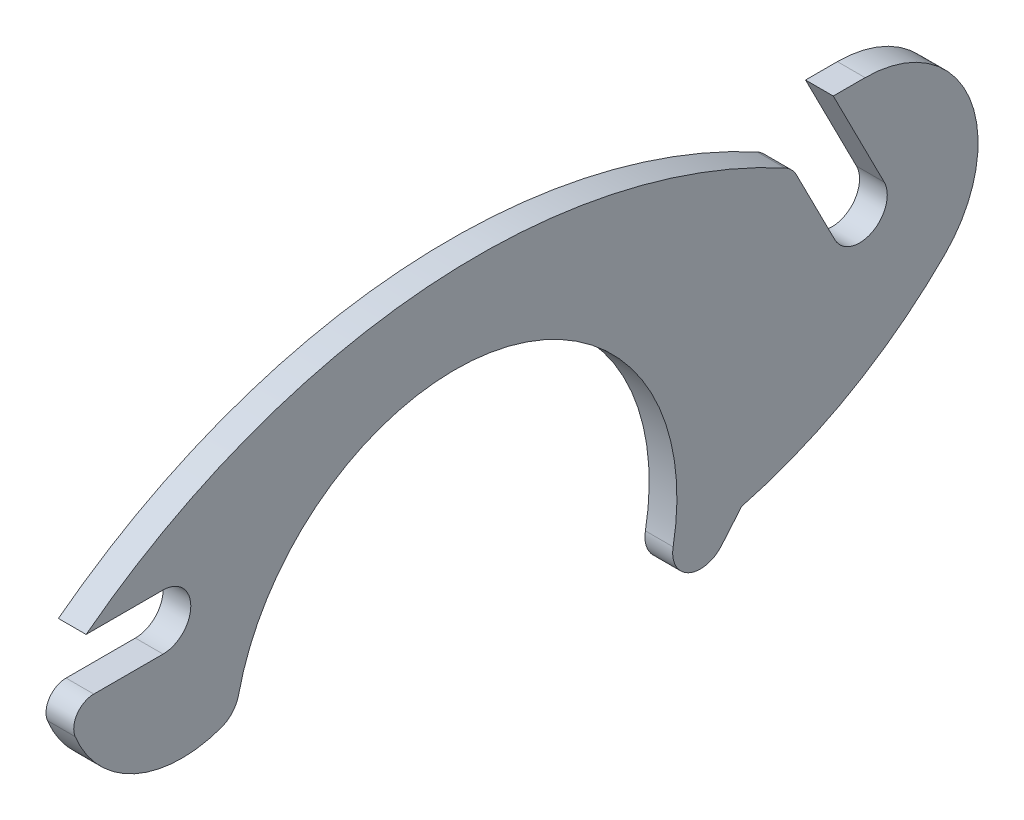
ISO-10303-21;
HEADER;
FILE_DESCRIPTION(('STEP AP214'),'2;1');
FILE_NAME('part.step','',(''),(''),'','','');
FILE_SCHEMA(('AUTOMOTIVE_DESIGN { 1 0 10303 214 1 1 1 1 }'));
ENDSEC;
DATA;
#1=APPLICATION_CONTEXT('core data for automotive mechanical design processes');
#2=APPLICATION_PROTOCOL_DEFINITION('international standard','automotive_design',2000,#1);
#3=PRODUCT_CONTEXT('',#1,'mechanical');
#4=PRODUCT('Part','Part','',(#3));
#5=PRODUCT_RELATED_PRODUCT_CATEGORY('part','',(#4));
#6=PRODUCT_DEFINITION_FORMATION('','',#4);
#7=PRODUCT_DEFINITION_CONTEXT('part definition',#1,'design');
#8=PRODUCT_DEFINITION('design','',#6,#7);
#9=PRODUCT_DEFINITION_SHAPE('','',#8);
#10=(LENGTH_UNIT() NAMED_UNIT(*) SI_UNIT(.MILLI.,.METRE.));
#11=(NAMED_UNIT(*) PLANE_ANGLE_UNIT() SI_UNIT($,.RADIAN.));
#12=(NAMED_UNIT(*) SI_UNIT($,.STERADIAN.) SOLID_ANGLE_UNIT());
#13=UNCERTAINTY_MEASURE_WITH_UNIT(LENGTH_MEASURE(1.E-05),#10,'distance_accuracy_value','');
#14=(GEOMETRIC_REPRESENTATION_CONTEXT(3) GLOBAL_UNCERTAINTY_ASSIGNED_CONTEXT((#13)) GLOBAL_UNIT_ASSIGNED_CONTEXT((#10,
#11,#12)) REPRESENTATION_CONTEXT('',''));
#15=CARTESIAN_POINT('',(0.,0.,0.));
#16=DIRECTION('',(0.,0.,1.));
#17=DIRECTION('',(1.,0.,0.));
#18=AXIS2_PLACEMENT_3D('',#15,#16,#17);
#19=CARTESIAN_POINT('',(2.,3.87717609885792,-3.05632741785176));
#20=DIRECTION('',(-1.,0.,0.));
#21=DIRECTION('',(0.,0.,1.));
#22=AXIS2_PLACEMENT_3D('',#19,#20,#21);
#23=CYLINDRICAL_SURFACE('',#22,1.99369295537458);
#24=CARTESIAN_POINT('',(0.,3.87717609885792,-3.05632741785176));
#25=DIRECTION('',(1.,0.,0.));
#26=DIRECTION('',(0.,0.,-1.));
#27=AXIS2_PLACEMENT_3D('',#24,#25,#26);
#28=CIRCLE('',#27,1.99369295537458);
#29=CARTESIAN_POINT('',(0.,2.00102391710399,-3.7307639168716));
#30=VERTEX_POINT('',#29);
#31=CARTESIAN_POINT('',(0.,3.44092293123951,-5.00170521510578));
#32=VERTEX_POINT('',#31);
#33=EDGE_CURVE('E183',#30,#32,#28,.T.);
#34=ORIENTED_EDGE('',*,*,#33,.T.);
#35=DIRECTION('',(-1.,0.,0.));
#36=VECTOR('',#35,1.);
#37=CARTESIAN_POINT('',(2.,3.44092293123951,-5.00170521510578));
#38=LINE('',#37,#36);
#39=CARTESIAN_POINT('',(2.,3.44092293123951,-5.00170521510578));
#40=VERTEX_POINT('',#39);
#41=EDGE_CURVE('E11',#40,#32,#38,.T.);
#42=ORIENTED_EDGE('',*,*,#41,.F.);
#43=CARTESIAN_POINT('',(2.,3.87717609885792,-3.05632741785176));
#44=DIRECTION('',(1.,0.,0.));
#45=DIRECTION('',(0.,0.,-1.));
#46=AXIS2_PLACEMENT_3D('',#43,#44,#45);
#47=CIRCLE('',#46,1.99369295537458);
#48=CARTESIAN_POINT('',(2.,2.00102391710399,-3.7307639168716));
#49=VERTEX_POINT('',#48);
#50=EDGE_CURVE('E215',#49,#40,#47,.T.);
#51=ORIENTED_EDGE('',*,*,#50,.F.);
#52=DIRECTION('',(-1.,0.,0.));
#53=VECTOR('',#52,1.);
#54=CARTESIAN_POINT('',(2.,2.00102391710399,-3.7307639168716));
#55=LINE('',#54,#53);
#56=EDGE_CURVE('E179',#49,#30,#55,.T.);
#57=ORIENTED_EDGE('',*,*,#56,.T.);
#58=EDGE_LOOP('',(#34,#42,#51,#57));
#59=FACE_BOUND('',#58,.T.);
#60=ADVANCED_FACE('F33',(#59),#23,.T.);
#61=CARTESIAN_POINT('',(2.,-0.0601430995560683,-20.613961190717));
#62=DIRECTION('',(-1.,0.,0.));
#63=DIRECTION('',(0.,0.,1.));
#64=AXIS2_PLACEMENT_3D('',#61,#62,#63);
#65=CYLINDRICAL_SURFACE('',#64,16.);
#66=CARTESIAN_POINT('',(0.,-0.0601430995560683,-20.613961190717));
#67=DIRECTION('',(-1.,0.,0.));
#68=DIRECTION('',(0.,0.,1.));
#69=AXIS2_PLACEMENT_3D('',#66,#67,#68);
#70=CIRCLE('',#69,16.);
#71=CARTESIAN_POINT('',(0.,-3.00000000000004,-36.3415560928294));
#72=VERTEX_POINT('',#71);
#73=EDGE_CURVE('E186',#32,#72,#70,.T.);
#74=ORIENTED_EDGE('',*,*,#73,.T.);
#75=DIRECTION('',(-1.,0.,0.));
#76=VECTOR('',#75,1.);
#77=CARTESIAN_POINT('',(2.,-3.00000000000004,-36.3415560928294));
#78=LINE('',#77,#76);
#79=CARTESIAN_POINT('',(2.,-3.00000000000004,-36.3415560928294));
#80=VERTEX_POINT('',#79);
#81=EDGE_CURVE('E41',#80,#72,#78,.T.);
#82=ORIENTED_EDGE('',*,*,#81,.F.);
#83=CARTESIAN_POINT('',(2.,-0.0601430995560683,-20.613961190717));
#84=DIRECTION('',(-1.,0.,0.));
#85=DIRECTION('',(0.,0.,1.));
#86=AXIS2_PLACEMENT_3D('',#83,#84,#85);
#87=CIRCLE('',#86,16.);
#88=EDGE_CURVE('E119',#40,#80,#87,.T.);
#89=ORIENTED_EDGE('',*,*,#88,.F.);
#90=ORIENTED_EDGE('',*,*,#41,.T.);
#91=EDGE_LOOP('',(#74,#82,#89,#90));
#92=FACE_BOUND('',#91,.T.);
#93=ADVANCED_FACE('F318',(#92),#65,.F.);
#94=CARTESIAN_POINT('',(2.,-3.36748211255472,-38.3075054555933));
#95=DIRECTION('',(-1.,0.,0.));
#96=DIRECTION('',(0.,0.,1.));
#97=AXIS2_PLACEMENT_3D('',#94,#95,#96);
#98=CYLINDRICAL_SURFACE('',#97,1.99999999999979);
#99=CARTESIAN_POINT('',(0.,-3.36748211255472,-38.3075054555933));
#100=DIRECTION('',(1.,0.,0.));
#101=DIRECTION('',(0.,0.,-1.));
#102=AXIS2_PLACEMENT_3D('',#99,#100,#101);
#103=CIRCLE('',#102,1.99999999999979);
#104=CARTESIAN_POINT('',(0.,-4.65605414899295,-39.8370747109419));
#105=VERTEX_POINT('',#104);
#106=EDGE_CURVE('E188',#72,#105,#103,.T.);
#107=ORIENTED_EDGE('',*,*,#106,.T.);
#108=DIRECTION('',(-1.,0.,0.));
#109=VECTOR('',#108,1.);
#110=CARTESIAN_POINT('',(2.,-4.65605414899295,-39.8370747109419));
#111=LINE('',#110,#109);
#112=CARTESIAN_POINT('',(2.,-4.65605414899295,-39.8370747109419));
#113=VERTEX_POINT('',#112);
#114=EDGE_CURVE('E249',#113,#105,#111,.T.);
#115=ORIENTED_EDGE('',*,*,#114,.F.);
#116=CARTESIAN_POINT('',(2.,-3.36748211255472,-38.3075054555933));
#117=DIRECTION('',(1.,0.,0.));
#118=DIRECTION('',(0.,0.,-1.));
#119=AXIS2_PLACEMENT_3D('',#116,#117,#118);
#120=CIRCLE('',#119,1.99999999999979);
#121=EDGE_CURVE('E257',#80,#113,#120,.T.);
#122=ORIENTED_EDGE('',*,*,#121,.F.);
#123=ORIENTED_EDGE('',*,*,#81,.T.);
#124=EDGE_LOOP('',(#107,#115,#122,#123));
#125=FACE_BOUND('',#124,.T.);
#126=ADVANCED_FACE('F255',(#125),#98,.T.);
#127=CARTESIAN_POINT('',(2.,-4.65605414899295,-39.8370747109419));
#128=DIRECTION('',(0.,0.644286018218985,0.764784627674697));
#129=DIRECTION('',(0.,-0.764784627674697,0.644286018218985));
#130=AXIS2_PLACEMENT_3D('',#127,#128,#129);
#131=PLANE('',#130);
#132=DIRECTION('',(0.,0.764784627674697,-0.644286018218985));
#133=VECTOR('',#132,1.);
#134=CARTESIAN_POINT('',(0.,-4.65605414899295,-39.8370747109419));
#135=LINE('',#134,#133);
#136=CARTESIAN_POINT('',(0.,-2.94594373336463,-41.2777420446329));
#137=VERTEX_POINT('',#136);
#138=EDGE_CURVE('E190',#105,#137,#135,.T.);
#139=ORIENTED_EDGE('',*,*,#138,.T.);
#140=DIRECTION('',(-1.,0.,0.));
#141=VECTOR('',#140,1.);
#142=CARTESIAN_POINT('',(2.,-2.94594373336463,-41.2777420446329));
#143=LINE('',#142,#141);
#144=CARTESIAN_POINT('',(2.,-2.94594373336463,-41.2777420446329));
#145=VERTEX_POINT('',#144);
#146=EDGE_CURVE('E246',#145,#137,#143,.T.);
#147=ORIENTED_EDGE('',*,*,#146,.F.);
#148=DIRECTION('',(0.,0.764784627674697,-0.644286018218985));
#149=VECTOR('',#148,1.);
#150=CARTESIAN_POINT('',(2.,-4.65605414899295,-39.8370747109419));
#151=LINE('',#150,#149);
#152=EDGE_CURVE('E275',#113,#145,#151,.T.);
#153=ORIENTED_EDGE('',*,*,#152,.F.);
#154=ORIENTED_EDGE('',*,*,#114,.T.);
#155=EDGE_LOOP('',(#139,#147,#153,#154));
#156=FACE_BOUND('',#155,.T.);
#157=ADVANCED_FACE('F266',(#156),#131,.F.);
#158=CARTESIAN_POINT('',(2.,28.2984724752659,-33.0923922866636));
#159=DIRECTION('',(-1.,0.,0.));
#160=DIRECTION('',(0.,0.,1.));
#161=AXIS2_PLACEMENT_3D('',#158,#159,#160);
#162=CYLINDRICAL_SURFACE('',#161,32.2988156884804);
#163=CARTESIAN_POINT('',(0.,28.2984724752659,-33.0923922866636));
#164=DIRECTION('',(1.,0.,0.));
#165=DIRECTION('',(0.,0.,-1.));
#166=AXIS2_PLACEMENT_3D('',#163,#164,#165);
#167=CIRCLE('',#166,32.2988156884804);
#168=CARTESIAN_POINT('',(0.,5.48513913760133,-55.9564539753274));
#169=VERTEX_POINT('',#168);
#170=EDGE_CURVE('E192',#137,#169,#167,.T.);
#171=ORIENTED_EDGE('',*,*,#170,.T.);
#172=DIRECTION('',(-1.,0.,0.));
#173=VECTOR('',#172,1.);
#174=CARTESIAN_POINT('',(2.,5.48513913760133,-55.9564539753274));
#175=LINE('',#174,#173);
#176=CARTESIAN_POINT('',(2.,5.48513913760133,-55.9564539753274));
#177=VERTEX_POINT('',#176);
#178=EDGE_CURVE('E243',#177,#169,#175,.T.);
#179=ORIENTED_EDGE('',*,*,#178,.F.);
#180=CARTESIAN_POINT('',(2.,28.2984724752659,-33.0923922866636));
#181=DIRECTION('',(1.,0.,0.));
#182=DIRECTION('',(0.,0.,-1.));
#183=AXIS2_PLACEMENT_3D('',#180,#181,#182);
#184=CIRCLE('',#183,32.2988156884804);
#185=EDGE_CURVE('E272',#145,#177,#184,.T.);
#186=ORIENTED_EDGE('',*,*,#185,.F.);
#187=ORIENTED_EDGE('',*,*,#146,.T.);
#188=EDGE_LOOP('',(#171,#179,#186,#187));
#189=FACE_BOUND('',#188,.T.);
#190=ADVANCED_FACE('F270',(#189),#162,.T.);
#191=CARTESIAN_POINT('',(2.,11.2406305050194,-50.188164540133));
#192=DIRECTION('',(-1.,0.,0.));
#193=DIRECTION('',(0.,0.,1.));
#194=AXIS2_PLACEMENT_3D('',#191,#192,#193);
#195=CYLINDRICAL_SURFACE('',#194,8.14854857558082);
#196=CARTESIAN_POINT('',(0.,11.2406305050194,-50.188164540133));
#197=DIRECTION('',(1.,0.,0.));
#198=DIRECTION('',(0.,0.,1.));
#199=AXIS2_PLACEMENT_3D('',#196,#197,#198);
#200=CIRCLE('',#199,8.14854857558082);
#201=CARTESIAN_POINT('',(0.,19.3891790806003,-50.188164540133));
#202=VERTEX_POINT('',#201);
#203=EDGE_CURVE('E194',#169,#202,#200,.T.);
#204=ORIENTED_EDGE('',*,*,#203,.T.);
#205=DIRECTION('',(-1.,0.,0.));
#206=VECTOR('',#205,1.);
#207=CARTESIAN_POINT('',(2.,19.3891790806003,-50.188164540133));
#208=LINE('',#207,#206);
#209=CARTESIAN_POINT('',(2.,19.3891790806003,-50.188164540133));
#210=VERTEX_POINT('',#209);
#211=EDGE_CURVE('E240',#210,#202,#208,.T.);
#212=ORIENTED_EDGE('',*,*,#211,.F.);
#213=CARTESIAN_POINT('',(2.,11.2406305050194,-50.188164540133));
#214=DIRECTION('',(1.,0.,0.));
#215=DIRECTION('',(0.,0.,1.));
#216=AXIS2_PLACEMENT_3D('',#213,#214,#215);
#217=CIRCLE('',#216,8.14854857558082);
#218=EDGE_CURVE('E274',#177,#210,#217,.T.);
#219=ORIENTED_EDGE('',*,*,#218,.F.);
#220=ORIENTED_EDGE('',*,*,#178,.T.);
#221=EDGE_LOOP('',(#204,#212,#219,#220));
#222=FACE_BOUND('',#221,.T.);
#223=ADVANCED_FACE('F331',(#222),#195,.T.);
#224=CARTESIAN_POINT('',(2.,19.3891790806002,-47.891048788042));
#225=DIRECTION('',(0.,-1.,0.));
#226=DIRECTION('',(0.,0.,-1.));
#227=AXIS2_PLACEMENT_3D('',#224,#225,#226);
#228=PLANE('',#227);
#229=DIRECTION('',(0.,0.,1.));
#230=VECTOR('',#229,1.);
#231=CARTESIAN_POINT('',(0.,19.3891790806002,-47.891048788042));
#232=LINE('',#231,#230);
#233=CARTESIAN_POINT('',(0.,19.3891790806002,-47.891048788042));
#234=VERTEX_POINT('',#233);
#235=EDGE_CURVE('E196',#202,#234,#232,.T.);
#236=ORIENTED_EDGE('',*,*,#235,.T.);
#237=DIRECTION('',(-1.,0.,0.));
#238=VECTOR('',#237,1.);
#239=CARTESIAN_POINT('',(2.,19.3891790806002,-47.891048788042));
#240=LINE('',#239,#238);
#241=CARTESIAN_POINT('',(2.,19.3891790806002,-47.891048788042));
#242=VERTEX_POINT('',#241);
#243=EDGE_CURVE('E237',#242,#234,#240,.T.);
#244=ORIENTED_EDGE('',*,*,#243,.F.);
#245=DIRECTION('',(0.,0.,1.));
#246=VECTOR('',#245,1.);
#247=CARTESIAN_POINT('',(2.,19.3891790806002,-47.891048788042));
#248=LINE('',#247,#246);
#249=EDGE_CURVE('E277',#210,#242,#248,.T.);
#250=ORIENTED_EDGE('',*,*,#249,.F.);
#251=ORIENTED_EDGE('',*,*,#211,.T.);
#252=EDGE_LOOP('',(#236,#244,#250,#251));
#253=FACE_BOUND('',#252,.T.);
#254=ADVANCED_FACE('F334',(#253),#228,.F.);
#255=CARTESIAN_POINT('',(2.,19.3891790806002,-47.891048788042));
#256=DIRECTION('',(0.,0.453990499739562,-0.89100652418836));
#257=DIRECTION('',(0.,0.89100652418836,0.453990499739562));
#258=AXIS2_PLACEMENT_3D('',#255,#256,#257);
#259=PLANE('',#258);
#260=DIRECTION('',(0.,-0.89100652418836,-0.453990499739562));
#261=VECTOR('',#260,1.);
#262=CARTESIAN_POINT('',(0.,19.3891790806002,-47.891048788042));
#263=LINE('',#262,#261);
#264=CARTESIAN_POINT('',(0.,12.1715623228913,-51.5686082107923));
#265=VERTEX_POINT('',#264);
#266=EDGE_CURVE('E198',#234,#265,#263,.T.);
#267=ORIENTED_EDGE('',*,*,#266,.T.);
#268=DIRECTION('',(-1.,0.,0.));
#269=VECTOR('',#268,1.);
#270=CARTESIAN_POINT('',(2.,12.1715623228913,-51.5686082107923));
#271=LINE('',#270,#269);
#272=CARTESIAN_POINT('',(2.,12.1715623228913,-51.5686082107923));
#273=VERTEX_POINT('',#272);
#274=EDGE_CURVE('E234',#273,#265,#271,.T.);
#275=ORIENTED_EDGE('',*,*,#274,.F.);
#276=DIRECTION('',(0.,-0.89100652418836,-0.453990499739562));
#277=VECTOR('',#276,1.);
#278=CARTESIAN_POINT('',(2.,19.3891790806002,-47.891048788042));
#279=LINE('',#278,#277);
#280=EDGE_CURVE('E283',#242,#273,#279,.T.);
#281=ORIENTED_EDGE('',*,*,#280,.F.);
#282=ORIENTED_EDGE('',*,*,#243,.T.);
#283=EDGE_LOOP('',(#267,#275,#281,#282));
#284=FACE_BOUND('',#283,.T.);
#285=ADVANCED_FACE('F338',(#284),#259,.F.);
#286=CARTESIAN_POINT('',(2.,11.2635813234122,-49.7865951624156));
#287=DIRECTION('',(-1.,0.,0.));
#288=DIRECTION('',(0.,0.,1.));
#289=AXIS2_PLACEMENT_3D('',#286,#287,#288);
#290=CYLINDRICAL_SURFACE('',#289,2.);
#291=CARTESIAN_POINT('',(0.,11.2635813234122,-49.7865951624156));
#292=DIRECTION('',(-1.,0.,0.));
#293=DIRECTION('',(0.,0.,-1.));
#294=AXIS2_PLACEMENT_3D('',#291,#292,#293);
#295=CIRCLE('',#294,2.);
#296=CARTESIAN_POINT('',(0.,10.3556003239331,-48.0045821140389));
#297=VERTEX_POINT('',#296);
#298=EDGE_CURVE('E200',#265,#297,#295,.T.);
#299=ORIENTED_EDGE('',*,*,#298,.T.);
#300=DIRECTION('',(-1.,0.,0.));
#301=VECTOR('',#300,1.);
#302=CARTESIAN_POINT('',(2.,10.3556003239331,-48.0045821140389));
#303=LINE('',#302,#301);
#304=CARTESIAN_POINT('',(2.,10.3556003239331,-48.0045821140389));
#305=VERTEX_POINT('',#304);
#306=EDGE_CURVE('E231',#305,#297,#303,.T.);
#307=ORIENTED_EDGE('',*,*,#306,.F.);
#308=CARTESIAN_POINT('',(2.,11.2635813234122,-49.7865951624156));
#309=DIRECTION('',(-1.,0.,0.));
#310=DIRECTION('',(0.,0.,-1.));
#311=AXIS2_PLACEMENT_3D('',#308,#309,#310);
#312=CIRCLE('',#311,2.);
#313=EDGE_CURVE('E285',#273,#305,#312,.T.);
#314=ORIENTED_EDGE('',*,*,#313,.F.);
#315=ORIENTED_EDGE('',*,*,#274,.T.);
#316=EDGE_LOOP('',(#299,#307,#314,#315));
#317=FACE_BOUND('',#316,.T.);
#318=ADVANCED_FACE('F342',(#317),#290,.F.);
#319=CARTESIAN_POINT('',(2.,15.7860633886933,-45.2376229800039));
#320=DIRECTION('',(0.,-0.453990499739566,0.891006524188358));
#321=DIRECTION('',(0.,-0.891006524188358,-0.453990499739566));
#322=AXIS2_PLACEMENT_3D('',#319,#320,#321);
#323=PLANE('',#322);
#324=DIRECTION('',(0.,0.891006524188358,0.453990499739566));
#325=VECTOR('',#324,1.);
#326=CARTESIAN_POINT('',(0.,15.7860633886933,-45.2376229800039));
#327=LINE('',#326,#325);
#328=CARTESIAN_POINT('',(0.,15.7860633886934,-45.2376229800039));
#329=VERTEX_POINT('',#328);
#330=EDGE_CURVE('E202',#297,#329,#327,.T.);
#331=ORIENTED_EDGE('',*,*,#330,.T.);
#332=DIRECTION('',(-1.,0.,0.));
#333=VECTOR('',#332,1.);
#334=CARTESIAN_POINT('',(2.,15.7860633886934,-45.2376229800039));
#335=LINE('',#334,#333);
#336=CARTESIAN_POINT('',(2.,15.7860633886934,-45.2376229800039));
#337=VERTEX_POINT('',#336);
#338=EDGE_CURVE('E228',#337,#329,#335,.T.);
#339=ORIENTED_EDGE('',*,*,#338,.F.);
#340=DIRECTION('',(0.,0.891006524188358,0.453990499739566));
#341=VECTOR('',#340,1.);
#342=CARTESIAN_POINT('',(2.,15.7860633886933,-45.2376229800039));
#343=LINE('',#342,#341);
#344=EDGE_CURVE('E287',#305,#337,#343,.T.);
#345=ORIENTED_EDGE('',*,*,#344,.F.);
#346=ORIENTED_EDGE('',*,*,#306,.T.);
#347=EDGE_LOOP('',(#331,#339,#345,#346));
#348=FACE_BOUND('',#347,.T.);
#349=ADVANCED_FACE('F346',(#348),#323,.F.);
#350=CARTESIAN_POINT('',(2.,14.8809457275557,-43.4612295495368));
#351=DIRECTION('',(-1.,0.,0.));
#352=DIRECTION('',(0.,0.,1.));
#353=AXIS2_PLACEMENT_3D('',#350,#351,#352);
#354=CYLINDRICAL_SURFACE('',#353,1.99369295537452);
#355=CARTESIAN_POINT('',(0.,14.8809457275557,-43.4612295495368));
#356=DIRECTION('',(1.,0.,0.));
#357=DIRECTION('',(0.,0.,1.));
#358=AXIS2_PLACEMENT_3D('',#355,#356,#357);
#359=CIRCLE('',#358,1.99369295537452);
#360=CARTESIAN_POINT('',(0.,16.6346241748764,-44.4096089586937));
#361=VERTEX_POINT('',#360);
#362=EDGE_CURVE('E204',#329,#361,#359,.T.);
#363=ORIENTED_EDGE('',*,*,#362,.T.);
#364=DIRECTION('',(-1.,0.,0.));
#365=VECTOR('',#364,1.);
#366=CARTESIAN_POINT('',(2.,16.6346241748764,-44.4096089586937));
#367=LINE('',#366,#365);
#368=CARTESIAN_POINT('',(2.,16.6346241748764,-44.4096089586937));
#369=VERTEX_POINT('',#368);
#370=EDGE_CURVE('E225',#369,#361,#367,.T.);
#371=ORIENTED_EDGE('',*,*,#370,.F.);
#372=CARTESIAN_POINT('',(2.,14.8809457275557,-43.4612295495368));
#373=DIRECTION('',(1.,0.,0.));
#374=DIRECTION('',(0.,0.,1.));
#375=AXIS2_PLACEMENT_3D('',#372,#373,#374);
#376=CIRCLE('',#375,1.99369295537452);
#377=EDGE_CURVE('E289',#337,#369,#376,.T.);
#378=ORIENTED_EDGE('',*,*,#377,.F.);
#379=ORIENTED_EDGE('',*,*,#338,.T.);
#380=EDGE_LOOP('',(#363,#371,#378,#379));
#381=FACE_BOUND('',#380,.T.);
#382=ADVANCED_FACE('F350',(#381),#354,.T.);
#383=CARTESIAN_POINT('',(2.,-24.3421312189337,-22.2496108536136));
#384=DIRECTION('',(-1.,0.,0.));
#385=DIRECTION('',(0.,0.,1.));
#386=AXIS2_PLACEMENT_3D('',#383,#384,#385);
#387=CYLINDRICAL_SURFACE('',#386,46.5849761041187);
#388=CARTESIAN_POINT('',(0.,-24.3421312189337,-22.2496108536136));
#389=DIRECTION('',(1.,0.,0.));
#390=DIRECTION('',(0.,0.,1.));
#391=AXIS2_PLACEMENT_3D('',#388,#389,#390);
#392=CIRCLE('',#391,46.5849761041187);
#393=CARTESIAN_POINT('',(0.,12.7,6.));
#394=VERTEX_POINT('',#393);
#395=EDGE_CURVE('E206',#361,#394,#392,.T.);
#396=ORIENTED_EDGE('',*,*,#395,.T.);
#397=DIRECTION('',(-1.,0.,0.));
#398=VECTOR('',#397,1.);
#399=CARTESIAN_POINT('',(2.,12.7,6.));
#400=LINE('',#399,#398);
#401=CARTESIAN_POINT('',(2.,12.7,6.));
#402=VERTEX_POINT('',#401);
#403=EDGE_CURVE('E222',#402,#394,#400,.T.);
#404=ORIENTED_EDGE('',*,*,#403,.F.);
#405=CARTESIAN_POINT('',(2.,-24.3421312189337,-22.2496108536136));
#406=DIRECTION('',(1.,0.,0.));
#407=DIRECTION('',(0.,0.,1.));
#408=AXIS2_PLACEMENT_3D('',#405,#406,#407);
#409=CIRCLE('',#408,46.5849761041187);
#410=EDGE_CURVE('E291',#369,#402,#409,.T.);
#411=ORIENTED_EDGE('',*,*,#410,.F.);
#412=ORIENTED_EDGE('',*,*,#370,.T.);
#413=EDGE_LOOP('',(#396,#404,#411,#412));
#414=FACE_BOUND('',#413,.T.);
#415=ADVANCED_FACE('F354',(#414),#387,.T.);
#416=CARTESIAN_POINT('',(2.,12.7,6.));
#417=DIRECTION('',(0.,1.,0.));
#418=DIRECTION('',(0.,0.,1.));
#419=AXIS2_PLACEMENT_3D('',#416,#417,#418);
#420=PLANE('',#419);
#421=DIRECTION('',(0.,0.,-1.));
#422=VECTOR('',#421,1.);
#423=CARTESIAN_POINT('',(0.,12.7,6.));
#424=LINE('',#423,#422);
#425=CARTESIAN_POINT('',(0.,12.7,0.449608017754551));
#426=VERTEX_POINT('',#425);
#427=EDGE_CURVE('E208',#394,#426,#424,.T.);
#428=ORIENTED_EDGE('',*,*,#427,.T.);
#429=DIRECTION('',(-1.,0.,0.));
#430=VECTOR('',#429,1.);
#431=CARTESIAN_POINT('',(2.,12.7,0.449608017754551));
#432=LINE('',#431,#430);
#433=CARTESIAN_POINT('',(2.,12.7,0.449608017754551));
#434=VERTEX_POINT('',#433);
#435=EDGE_CURVE('E219',#434,#426,#432,.T.);
#436=ORIENTED_EDGE('',*,*,#435,.F.);
#437=DIRECTION('',(0.,0.,-1.));
#438=VECTOR('',#437,1.);
#439=CARTESIAN_POINT('',(2.,12.7,6.));
#440=LINE('',#439,#438);
#441=EDGE_CURVE('E293',#402,#434,#440,.T.);
#442=ORIENTED_EDGE('',*,*,#441,.F.);
#443=ORIENTED_EDGE('',*,*,#403,.T.);
#444=EDGE_LOOP('',(#428,#436,#442,#443));
#445=FACE_BOUND('',#444,.T.);
#446=ADVANCED_FACE('F299',(#445),#420,.F.);
#447=CARTESIAN_POINT('',(2.,10.7,0.449608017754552));
#448=DIRECTION('',(-1.,0.,0.));
#449=DIRECTION('',(0.,0.,1.));
#450=AXIS2_PLACEMENT_3D('',#447,#448,#449);
#451=CYLINDRICAL_SURFACE('',#450,2.);
#452=CARTESIAN_POINT('',(0.,10.7,0.449608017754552));
#453=DIRECTION('',(-1.,0.,0.));
#454=DIRECTION('',(0.,0.,-1.));
#455=AXIS2_PLACEMENT_3D('',#452,#453,#454);
#456=CIRCLE('',#455,2.);
#457=CARTESIAN_POINT('',(0.,8.7,0.449608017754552));
#458=VERTEX_POINT('',#457);
#459=EDGE_CURVE('E210',#426,#458,#456,.T.);
#460=ORIENTED_EDGE('',*,*,#459,.T.);
#461=DIRECTION('',(-1.,0.,0.));
#462=VECTOR('',#461,1.);
#463=CARTESIAN_POINT('',(2.,8.7,0.449608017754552));
#464=LINE('',#463,#462);
#465=CARTESIAN_POINT('',(2.,8.7,0.449608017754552));
#466=VERTEX_POINT('',#465);
#467=EDGE_CURVE('E174',#466,#458,#464,.T.);
#468=ORIENTED_EDGE('',*,*,#467,.F.);
#469=CARTESIAN_POINT('',(2.,10.7,0.449608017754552));
#470=DIRECTION('',(-1.,0.,0.));
#471=DIRECTION('',(0.,0.,-1.));
#472=AXIS2_PLACEMENT_3D('',#469,#470,#471);
#473=CIRCLE('',#472,2.);
#474=EDGE_CURVE('E165',#434,#466,#473,.T.);
#475=ORIENTED_EDGE('',*,*,#474,.F.);
#476=ORIENTED_EDGE('',*,*,#435,.T.);
#477=EDGE_LOOP('',(#460,#468,#475,#476));
#478=FACE_BOUND('',#477,.T.);
#479=ADVANCED_FACE('F303',(#478),#451,.F.);
#480=CARTESIAN_POINT('',(2.,8.7,5.44637306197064));
#481=DIRECTION('',(0.,-1.,0.));
#482=DIRECTION('',(0.,0.,-1.));
#483=AXIS2_PLACEMENT_3D('',#480,#481,#482);
#484=PLANE('',#483);
#485=DIRECTION('',(0.,0.,1.));
#486=VECTOR('',#485,1.);
#487=CARTESIAN_POINT('',(0.,8.7,5.44637306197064));
#488=LINE('',#487,#486);
#489=CARTESIAN_POINT('',(0.,8.7,5.44637306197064));
#490=VERTEX_POINT('',#489);
#491=EDGE_CURVE('E173',#458,#490,#488,.T.);
#492=ORIENTED_EDGE('',*,*,#491,.T.);
#493=DIRECTION('',(-1.,0.,0.));
#494=VECTOR('',#493,1.);
#495=CARTESIAN_POINT('',(2.,8.7,5.44637306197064));
#496=LINE('',#495,#494);
#497=CARTESIAN_POINT('',(2.,8.7,5.44637306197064));
#498=VERTEX_POINT('',#497);
#499=EDGE_CURVE('E170',#498,#490,#496,.T.);
#500=ORIENTED_EDGE('',*,*,#499,.F.);
#501=DIRECTION('',(0.,0.,1.));
#502=VECTOR('',#501,1.);
#503=CARTESIAN_POINT('',(2.,8.7,5.44637306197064));
#504=LINE('',#503,#502);
#505=EDGE_CURVE('E159',#466,#498,#504,.T.);
#506=ORIENTED_EDGE('',*,*,#505,.F.);
#507=ORIENTED_EDGE('',*,*,#467,.T.);
#508=EDGE_LOOP('',(#492,#500,#506,#507));
#509=FACE_BOUND('',#508,.T.);
#510=ADVANCED_FACE('F171',(#509),#484,.F.);
#511=CARTESIAN_POINT('',(2.,7.25264528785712,5.44637306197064));
#512=DIRECTION('',(-1.,0.,0.));
#513=DIRECTION('',(0.,0.,1.));
#514=AXIS2_PLACEMENT_3D('',#511,#512,#513);
#515=CYLINDRICAL_SURFACE('',#514,1.44735471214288);
#516=CARTESIAN_POINT('',(0.,7.25264528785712,5.44637306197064));
#517=DIRECTION('',(1.,0.,0.));
#518=DIRECTION('',(0.,0.,1.));
#519=AXIS2_PLACEMENT_3D('',#516,#517,#518);
#520=CIRCLE('',#519,1.44735471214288);
#521=CARTESIAN_POINT('',(0.,6.71070716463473,6.78843816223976));
#522=VERTEX_POINT('',#521);
#523=EDGE_CURVE('E105',#490,#522,#520,.T.);
#524=ORIENTED_EDGE('',*,*,#523,.T.);
#525=DIRECTION('',(-1.,0.,0.));
#526=VECTOR('',#525,1.);
#527=CARTESIAN_POINT('',(2.,6.71070716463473,6.78843816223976));
#528=LINE('',#527,#526);
#529=CARTESIAN_POINT('',(2.,6.71070716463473,6.78843816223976));
#530=VERTEX_POINT('',#529);
#531=EDGE_CURVE('E175',#530,#522,#528,.T.);
#532=ORIENTED_EDGE('',*,*,#531,.F.);
#533=CARTESIAN_POINT('',(2.,7.25264528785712,5.44637306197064));
#534=DIRECTION('',(1.,0.,0.));
#535=DIRECTION('',(0.,0.,1.));
#536=AXIS2_PLACEMENT_3D('',#533,#534,#535);
#537=CIRCLE('',#536,1.44735471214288);
#538=EDGE_CURVE('E163',#498,#530,#537,.T.);
#539=ORIENTED_EDGE('',*,*,#538,.F.);
#540=ORIENTED_EDGE('',*,*,#499,.T.);
#541=EDGE_LOOP('',(#524,#532,#539,#540));
#542=FACE_BOUND('',#541,.T.);
#543=ADVANCED_FACE('F177',(#542),#515,.T.);
#544=CARTESIAN_POINT('',(2.,9.8230114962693,-0.918927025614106));
#545=DIRECTION('',(-1.,0.,0.));
#546=DIRECTION('',(0.,0.,1.));
#547=AXIS2_PLACEMENT_3D('',#544,#545,#546);
#548=CYLINDRICAL_SURFACE('',#547,8.31203443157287);
#549=CARTESIAN_POINT('',(0.,9.8230114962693,-0.918927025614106));
#550=DIRECTION('',(1.,0.,0.));
#551=DIRECTION('',(0.,0.,1.));
#552=AXIS2_PLACEMENT_3D('',#549,#550,#551);
#553=CIRCLE('',#552,8.31203443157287);
#554=EDGE_CURVE('E111',#522,#30,#553,.T.);
#555=ORIENTED_EDGE('',*,*,#554,.T.);
#556=ORIENTED_EDGE('',*,*,#56,.F.);
#557=CARTESIAN_POINT('',(2.,9.8230114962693,-0.918927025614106));
#558=DIRECTION('',(1.,0.,0.));
#559=DIRECTION('',(0.,0.,1.));
#560=AXIS2_PLACEMENT_3D('',#557,#558,#559);
#561=CIRCLE('',#560,8.31203443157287);
#562=EDGE_CURVE('E49',#530,#49,#561,.T.);
#563=ORIENTED_EDGE('',*,*,#562,.F.);
#564=ORIENTED_EDGE('',*,*,#531,.T.);
#565=EDGE_LOOP('',(#555,#556,#563,#564));
#566=FACE_BOUND('',#565,.T.);
#567=ADVANCED_FACE('F307',(#566),#548,.T.);
#568=CARTESIAN_POINT('',(2.,3.87717609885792,-3.05632741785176));
#569=DIRECTION('',(1.,0.,0.));
#570=DIRECTION('',(0.,0.,-1.));
#571=AXIS2_PLACEMENT_3D('',#568,#569,#570);
#572=PLANE('',#571);
#573=ORIENTED_EDGE('',*,*,#50,.T.);
#574=ORIENTED_EDGE('',*,*,#88,.T.);
#575=ORIENTED_EDGE('',*,*,#121,.T.);
#576=ORIENTED_EDGE('',*,*,#152,.T.);
#577=ORIENTED_EDGE('',*,*,#185,.T.);
#578=ORIENTED_EDGE('',*,*,#218,.T.);
#579=ORIENTED_EDGE('',*,*,#249,.T.);
#580=ORIENTED_EDGE('',*,*,#280,.T.);
#581=ORIENTED_EDGE('',*,*,#313,.T.);
#582=ORIENTED_EDGE('',*,*,#344,.T.);
#583=ORIENTED_EDGE('',*,*,#377,.T.);
#584=ORIENTED_EDGE('',*,*,#410,.T.);
#585=ORIENTED_EDGE('',*,*,#441,.T.);
#586=ORIENTED_EDGE('',*,*,#474,.T.);
#587=ORIENTED_EDGE('',*,*,#505,.T.);
#588=ORIENTED_EDGE('',*,*,#538,.T.);
#589=ORIENTED_EDGE('',*,*,#562,.T.);
#590=EDGE_LOOP('',(#573,#574,#575,#576,#577,#578,#579,#580,#581,#582,#583,#584,#585,#586,#587,
#588,#589));
#591=FACE_BOUND('',#590,.T.);
#592=ADVANCED_FACE('F161',(#591),#572,.T.);
#593=CARTESIAN_POINT('',(0.,3.87717609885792,-3.05632741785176));
#594=DIRECTION('',(1.,0.,0.));
#595=DIRECTION('',(0.,0.,-1.));
#596=AXIS2_PLACEMENT_3D('',#593,#594,#595);
#597=PLANE('',#596);
#598=ORIENTED_EDGE('',*,*,#33,.F.);
#599=ORIENTED_EDGE('',*,*,#554,.F.);
#600=ORIENTED_EDGE('',*,*,#523,.F.);
#601=ORIENTED_EDGE('',*,*,#491,.F.);
#602=ORIENTED_EDGE('',*,*,#459,.F.);
#603=ORIENTED_EDGE('',*,*,#427,.F.);
#604=ORIENTED_EDGE('',*,*,#395,.F.);
#605=ORIENTED_EDGE('',*,*,#362,.F.);
#606=ORIENTED_EDGE('',*,*,#330,.F.);
#607=ORIENTED_EDGE('',*,*,#298,.F.);
#608=ORIENTED_EDGE('',*,*,#266,.F.);
#609=ORIENTED_EDGE('',*,*,#235,.F.);
#610=ORIENTED_EDGE('',*,*,#203,.F.);
#611=ORIENTED_EDGE('',*,*,#170,.F.);
#612=ORIENTED_EDGE('',*,*,#138,.F.);
#613=ORIENTED_EDGE('',*,*,#106,.F.);
#614=ORIENTED_EDGE('',*,*,#73,.F.);
#615=EDGE_LOOP('',(#598,#599,#600,#601,#602,#603,#604,#605,#606,#607,#608,#609,#610,#611,#612,
#613,#614));
#616=FACE_BOUND('',#615,.T.);
#617=ADVANCED_FACE('F261',(#616),#597,.F.);
#618=CLOSED_SHELL('',(#60,#93,#126,#157,#190,#223,#254,#285,#318,#349,#382,#415,#446,#479,#510,
#543,#567,#592,#617));
#619=MANIFOLD_SOLID_BREP('B2',#618);
#620=ADVANCED_BREP_SHAPE_REPRESENTATION('',(#18,#619),#14);
#621=SHAPE_DEFINITION_REPRESENTATION(#9,#620);
ENDSEC;
END-ISO-10303-21;
